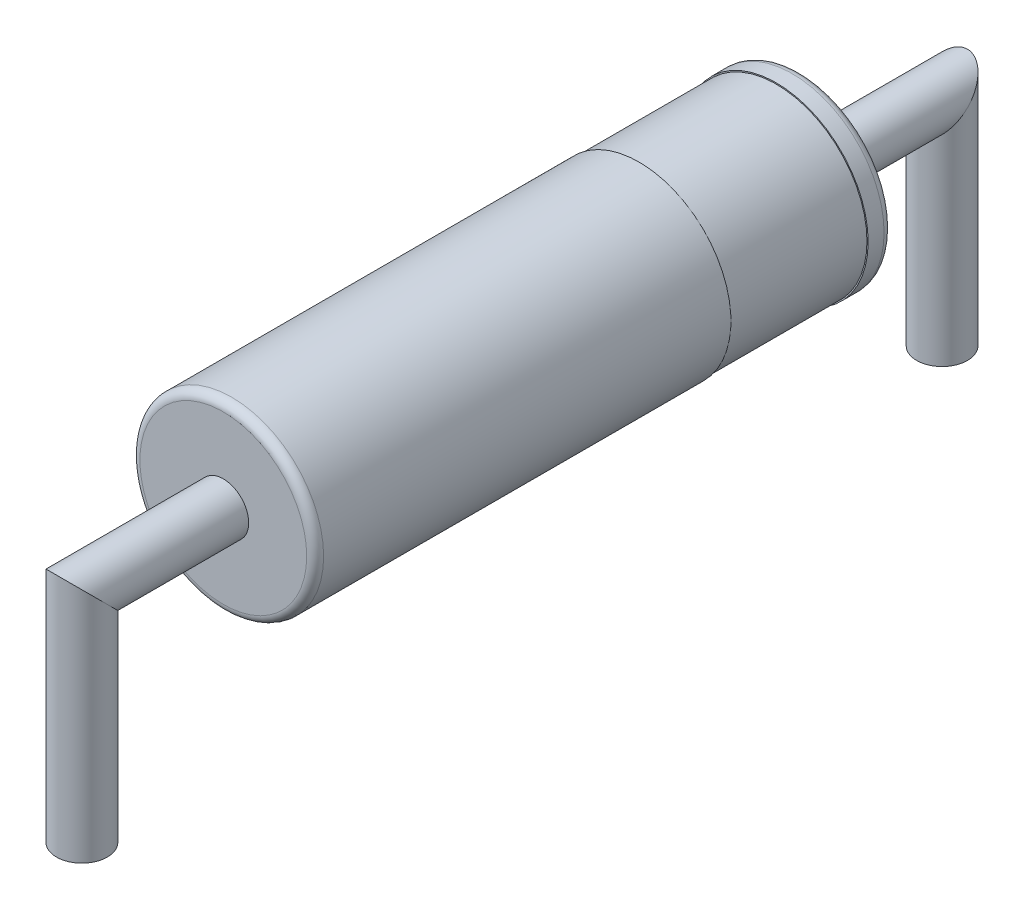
from build123d import *

# Parameters (mm, degrees)
ESQUISSE1_R      = 1.085
EXTRUSION1_DEPTH = 3.41
CONG_1_R         = 0.1
ESQUISSE2_R      = 0.3
ESQUISSE4_W      = 1.621102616
ESQUISSE4_H      = 0.082628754


with BuildPart() as part:
    # Esquisse1 → Extrusion1 (new, symmetric)
    with BuildSketch(Plane.XY):
        Circle(ESQUISSE1_R)
    extrude(amount=EXTRUSION1_DEPTH, both=True)

    # Cong_1
    cong_1_edges = [part.edges().sort_by_distance(p)[0] for p in [
        (-1.085, 0, -3.41),
        (-1.085, 0, 3.41),
    ]]
    fillet(cong_1_edges, radius=CONG_1_R)

    # Balayage1: sweep along a path in Esquisse3
    with BuildLine(Plane(origin=(0, 0, 0), x_dir=(0, 0, -1), z_dir=(1, 0, 0))) as balayage1_path:
        Line((3.41, 0), (5.08, 0))
        Line((5.08, 0), (5.08, -2.585))
    # Esquisse2 → Balayage1 (sweep)
    with BuildSketch(Plane(origin=(0, 0, -3.41), x_dir=(-1, 0, 0), z_dir=(0, 0, -1))):
        Circle(ESQUISSE2_R)
    balayage1 = sweep(path=balayage1_path.line, transition=Transition.RIGHT)

    # Sym_trie1: Balayage1 across plane
    add(balayage1.mirror(Plane.XY))

    # Esquisse4 → Enl_vement de mati_re-R_volution1 (revolve, cut)
    with BuildSketch(Plane(origin=(0, 0, 0), x_dir=(0, 0, -1), z_dir=(1, 0, 0)), mode=Mode.PRIVATE) as enl_vement_de_mati_re_r_volution1_sk:
        with Locations((2.311378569, 1.11223235)):
            Rectangle(ESQUISSE4_W, ESQUISSE4_H)
    revolve(enl_vement_de_mati_re_r_volution1_sk.sketch.rotate(Axis((0, 0, 0), (0, 0, -1)), 90), axis=Axis((0, 0, 0), (0, 0, -1)), mode=Mode.SUBTRACT)


solid = part.part
